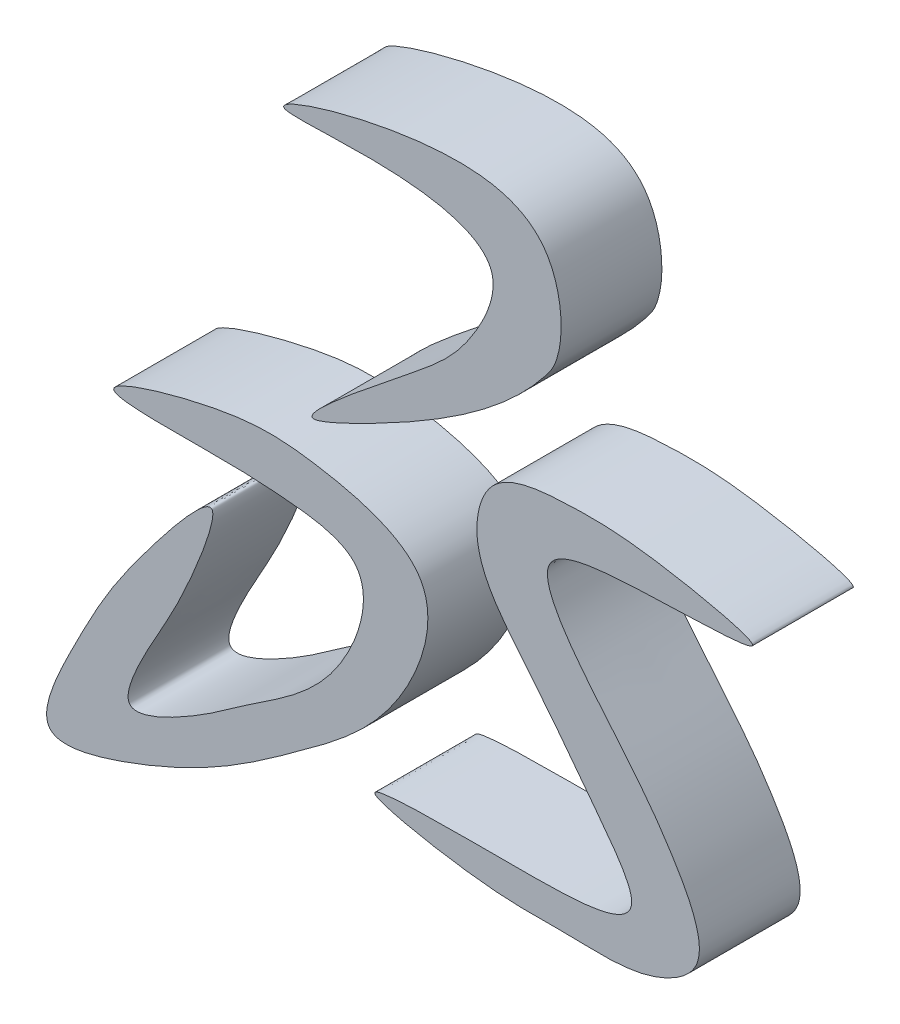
ISO-10303-21;
HEADER;
FILE_DESCRIPTION(('STEP AP214'),'2;1');
FILE_NAME('part.step','',(''),(''),'','','');
FILE_SCHEMA(('AUTOMOTIVE_DESIGN { 1 0 10303 214 1 1 1 1 }'));
ENDSEC;
DATA;
#1=APPLICATION_CONTEXT('core data for automotive mechanical design processes');
#2=APPLICATION_PROTOCOL_DEFINITION('international standard','automotive_design',2000,#1);
#3=PRODUCT_CONTEXT('',#1,'mechanical');
#4=PRODUCT('Part','Part','',(#3));
#5=PRODUCT_RELATED_PRODUCT_CATEGORY('part','',(#4));
#6=PRODUCT_DEFINITION_FORMATION('','',#4);
#7=PRODUCT_DEFINITION_CONTEXT('part definition',#1,'design');
#8=PRODUCT_DEFINITION('design','',#6,#7);
#9=PRODUCT_DEFINITION_SHAPE('','',#8);
#10=(LENGTH_UNIT() NAMED_UNIT(*) SI_UNIT(.MILLI.,.METRE.));
#11=(NAMED_UNIT(*) PLANE_ANGLE_UNIT() SI_UNIT($,.RADIAN.));
#12=(NAMED_UNIT(*) SI_UNIT($,.STERADIAN.) SOLID_ANGLE_UNIT());
#13=UNCERTAINTY_MEASURE_WITH_UNIT(LENGTH_MEASURE(1.E-05),#10,'distance_accuracy_value','');
#14=(GEOMETRIC_REPRESENTATION_CONTEXT(3) GLOBAL_UNCERTAINTY_ASSIGNED_CONTEXT((#13)) GLOBAL_UNIT_ASSIGNED_CONTEXT((#10,
#11,#12)) REPRESENTATION_CONTEXT('',''));
#15=CARTESIAN_POINT('',(0.,0.,0.));
#16=DIRECTION('',(0.,0.,1.));
#17=DIRECTION('',(1.,0.,0.));
#18=AXIS2_PLACEMENT_3D('',#15,#16,#17);
#19=CARTESIAN_POINT('',(-46.2111331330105,62.5617453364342,3.));
#20=CARTESIAN_POINT('',(-46.0700654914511,62.3706267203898,3.));
#21=CARTESIAN_POINT('',(-43.2617302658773,62.4180298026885,3.));
#22=CARTESIAN_POINT('',(-41.3856636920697,62.3727058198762,3.));
#23=CARTESIAN_POINT('',(-38.168710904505,62.0019418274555,3.));
#24=CARTESIAN_POINT('',(-39.4628284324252,58.088096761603,3.));
#25=CARTESIAN_POINT('',(-41.875880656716,56.7588453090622,3.));
#26=CARTESIAN_POINT('',(-43.5925380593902,55.439930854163,3.));
#27=CARTESIAN_POINT('',(-46.3846535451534,53.9492269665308,3.));
#28=CARTESIAN_POINT('',(-45.1347675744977,56.6142211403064,3.));
#29=CARTESIAN_POINT('',(-44.254641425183,57.9531861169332,3.));
#30=CARTESIAN_POINT('',(-42.4029236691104,62.5206770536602,3.));
#31=CARTESIAN_POINT('',(-46.0545791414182,57.9518081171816,3.));
#32=CARTESIAN_POINT('',(-46.9726148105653,56.2799210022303,3.));
#33=CARTESIAN_POINT('',(-49.0014656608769,52.1583720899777,3.));
#34=CARTESIAN_POINT('',(-43.955614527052,53.6691658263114,3.));
#35=CARTESIAN_POINT('',(-41.2268964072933,55.6348293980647,3.));
#36=CARTESIAN_POINT('',(-37.6594659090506,58.2344147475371,3.));
#37=CARTESIAN_POINT('',(-36.0458009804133,62.766264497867,3.));
#38=CARTESIAN_POINT('',(-40.2202416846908,63.7472162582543,3.));
#39=CARTESIAN_POINT('',(-42.7318745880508,63.8870764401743,3.));
#40=CARTESIAN_POINT('',(-46.3953175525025,62.8112786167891,3.));
#41=CARTESIAN_POINT('',(-46.2111331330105,62.5617453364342,3.));
#42=B_SPLINE_CURVE_WITH_KNOTS('',3,(#19,#20,#21,#22,#23,#24,#25,#26,#27,#28,#29,#30,#31,#32,#33,
#34,#35,#36,#37,#38,#39,#40,#41),.UNSPECIFIED.,.T.,.F.,(4,1,1,1,1,1,1,1,1,1,1,1,1,1,1,1,1,1,1,1,
4),(0.,0.0454444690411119,0.0860179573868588,0.122709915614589,0.172667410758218,
0.233439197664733,0.260911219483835,0.298832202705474,0.325903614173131,0.359106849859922,
0.412139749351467,0.4628705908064,0.530545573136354,0.573057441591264,0.614659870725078,
0.711680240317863,0.778007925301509,0.837923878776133,0.89671691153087,0.940665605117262,1.),.UNSPECIFIED.);
#43=DIRECTION('',(0.,0.,-1.));
#44=VECTOR('',#43,1.);
#45=SURFACE_OF_LINEAR_EXTRUSION('',#42,#44);
#46=CARTESIAN_POINT('',(-46.2111331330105,62.5617453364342,3.));
#47=VERTEX_POINT('',#46);
#48=EDGE_CURVE('E11',#47,#47,#42,.T.);
#49=ORIENTED_EDGE('',*,*,#48,.F.);
#50=EDGE_LOOP('',(#49));
#51=FACE_BOUND('',#50,.T.);
#52=CARTESIAN_POINT('',(-46.2111331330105,62.5617453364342,0.));
#53=CARTESIAN_POINT('',(-46.0700654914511,62.3706267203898,0.));
#54=CARTESIAN_POINT('',(-43.2617302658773,62.4180298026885,0.));
#55=CARTESIAN_POINT('',(-41.3856636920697,62.3727058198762,0.));
#56=CARTESIAN_POINT('',(-38.168710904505,62.0019418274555,0.));
#57=CARTESIAN_POINT('',(-39.4628284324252,58.088096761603,0.));
#58=CARTESIAN_POINT('',(-41.875880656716,56.7588453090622,0.));
#59=CARTESIAN_POINT('',(-43.5925380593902,55.439930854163,0.));
#60=CARTESIAN_POINT('',(-46.3846535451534,53.9492269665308,0.));
#61=CARTESIAN_POINT('',(-45.1347675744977,56.6142211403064,0.));
#62=CARTESIAN_POINT('',(-44.254641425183,57.9531861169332,0.));
#63=CARTESIAN_POINT('',(-42.4029236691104,62.5206770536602,0.));
#64=CARTESIAN_POINT('',(-46.0545791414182,57.9518081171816,0.));
#65=CARTESIAN_POINT('',(-46.9726148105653,56.2799210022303,0.));
#66=CARTESIAN_POINT('',(-49.0014656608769,52.1583720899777,0.));
#67=CARTESIAN_POINT('',(-43.955614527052,53.6691658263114,0.));
#68=CARTESIAN_POINT('',(-41.2268964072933,55.6348293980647,0.));
#69=CARTESIAN_POINT('',(-37.6594659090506,58.2344147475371,0.));
#70=CARTESIAN_POINT('',(-36.0458009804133,62.766264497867,0.));
#71=CARTESIAN_POINT('',(-40.2202416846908,63.7472162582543,0.));
#72=CARTESIAN_POINT('',(-42.7318745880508,63.8870764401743,0.));
#73=CARTESIAN_POINT('',(-46.3953175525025,62.8112786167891,0.));
#74=CARTESIAN_POINT('',(-46.2111331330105,62.5617453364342,0.));
#75=B_SPLINE_CURVE_WITH_KNOTS('',3,(#52,#53,#54,#55,#56,#57,#58,#59,#60,#61,#62,#63,#64,#65,#66,
#67,#68,#69,#70,#71,#72,#73,#74),.UNSPECIFIED.,.T.,.F.,(4,1,1,1,1,1,1,1,1,1,1,1,1,1,1,1,1,1,1,1,
4),(0.,0.0454444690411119,0.0860179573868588,0.122709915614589,0.172667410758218,
0.233439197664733,0.260911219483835,0.298832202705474,0.325903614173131,0.359106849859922,
0.412139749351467,0.4628705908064,0.530545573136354,0.573057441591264,0.614659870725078,
0.711680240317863,0.778007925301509,0.837923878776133,0.89671691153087,0.940665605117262,1.),.UNSPECIFIED.);
#76=CARTESIAN_POINT('',(-46.2111331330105,62.5617453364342,0.));
#77=VERTEX_POINT('',#76);
#78=EDGE_CURVE('E49',#77,#77,#75,.T.);
#79=ORIENTED_EDGE('',*,*,#78,.T.);
#80=EDGE_LOOP('',(#79));
#81=FACE_BOUND('',#80,.T.);
#82=ADVANCED_FACE('F40',(#51,#81),#45,.F.);
#83=CARTESIAN_POINT('',(-46.590505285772,56.913326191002,3.));
#84=DIRECTION('',(0.,0.,1.));
#85=DIRECTION('',(1.,0.,0.));
#86=AXIS2_PLACEMENT_3D('',#83,#84,#85);
#87=PLANE('',#86);
#88=ORIENTED_EDGE('',*,*,#48,.T.);
#89=EDGE_LOOP('',(#88));
#90=FACE_BOUND('',#89,.T.);
#91=ADVANCED_FACE('F63',(#90),#87,.T.);
#92=CARTESIAN_POINT('',(-46.590505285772,56.913326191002,0.));
#93=DIRECTION('',(0.,0.,1.));
#94=DIRECTION('',(1.,0.,0.));
#95=AXIS2_PLACEMENT_3D('',#92,#93,#94);
#96=PLANE('',#95);
#97=ORIENTED_EDGE('',*,*,#78,.F.);
#98=EDGE_LOOP('',(#97));
#99=FACE_BOUND('',#98,.T.);
#100=ADVANCED_FACE('F61',(#99),#96,.F.);
#101=CLOSED_SHELL('',(#82,#91,#100));
#102=MANIFOLD_SOLID_BREP('B2',#101);
#103=CARTESIAN_POINT('',(-27.2032125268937,65.5216252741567,3.));
#104=CARTESIAN_POINT('',(-27.2957513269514,65.7087479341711,3.));
#105=CARTESIAN_POINT('',(-30.401193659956,66.3779431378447,3.));
#106=CARTESIAN_POINT('',(-32.5028022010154,66.4305923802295,3.));
#107=CARTESIAN_POINT('',(-35.0869492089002,66.2004474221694,3.));
#108=CARTESIAN_POINT('',(-35.709623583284,63.6672111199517,3.));
#109=CARTESIAN_POINT('',(-33.7308738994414,61.3933329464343,3.));
#110=CARTESIAN_POINT('',(-32.255688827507,59.4394585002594,3.));
#111=CARTESIAN_POINT('',(-29.8577818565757,56.2642538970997,3.));
#112=CARTESIAN_POINT('',(-34.4820683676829,56.2565520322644,3.));
#113=CARTESIAN_POINT('',(-40.5638674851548,56.2776432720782,3.));
#114=CARTESIAN_POINT('',(-35.0414854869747,55.1977417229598,3.));
#115=CARTESIAN_POINT('',(-32.5750527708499,55.3413060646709,3.));
#116=CARTESIAN_POINT('',(-30.4744476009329,55.1576116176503,3.));
#117=CARTESIAN_POINT('',(-28.2469868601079,56.4648257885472,3.));
#118=CARTESIAN_POINT('',(-29.7911336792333,59.4102549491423,3.));
#119=CARTESIAN_POINT('',(-31.3912362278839,61.2189996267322,3.));
#120=CARTESIAN_POINT('',(-34.3822011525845,64.9286898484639,3.));
#121=CARTESIAN_POINT('',(-30.5138847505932,65.3200364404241,3.));
#122=CARTESIAN_POINT('',(-27.0981487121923,65.3091757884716,3.));
#123=CARTESIAN_POINT('',(-27.2032125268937,65.5216252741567,3.));
#124=B_SPLINE_CURVE_WITH_KNOTS('',3,(#103,#104,#105,#106,#107,#108,#109,#110,#111,#112,#113,
#114,#115,#116,#117,#118,#119,#120,#121,#122,#123),.UNSPECIFIED.,.T.,.F.,(4,1,1,1,1,1,1,1,1,1,1,
1,1,1,1,1,1,1,4),(0.,0.0593088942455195,0.111284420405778,0.1550555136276,0.185463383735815,
0.242406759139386,0.31459070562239,0.351733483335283,0.424525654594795,0.503042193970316,
0.576497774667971,0.617653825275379,0.666549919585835,0.69694507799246,0.745475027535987,
0.815497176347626,0.879518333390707,0.93266371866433,1.),.UNSPECIFIED.);
#125=DIRECTION('',(0.,0.,-1.));
#126=VECTOR('',#125,1.);
#127=SURFACE_OF_LINEAR_EXTRUSION('',#124,#126);
#128=CARTESIAN_POINT('',(-27.2032125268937,65.5216252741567,3.));
#129=VERTEX_POINT('',#128);
#130=EDGE_CURVE('E39',#129,#129,#124,.T.);
#131=ORIENTED_EDGE('',*,*,#130,.F.);
#132=EDGE_LOOP('',(#131));
#133=FACE_BOUND('',#132,.T.);
#134=CARTESIAN_POINT('',(-27.2032125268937,65.5216252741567,0.));
#135=CARTESIAN_POINT('',(-27.2957513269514,65.7087479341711,0.));
#136=CARTESIAN_POINT('',(-30.401193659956,66.3779431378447,0.));
#137=CARTESIAN_POINT('',(-32.5028022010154,66.4305923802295,0.));
#138=CARTESIAN_POINT('',(-35.0869492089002,66.2004474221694,0.));
#139=CARTESIAN_POINT('',(-35.709623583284,63.6672111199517,0.));
#140=CARTESIAN_POINT('',(-33.7308738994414,61.3933329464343,0.));
#141=CARTESIAN_POINT('',(-32.255688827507,59.4394585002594,0.));
#142=CARTESIAN_POINT('',(-29.8577818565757,56.2642538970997,0.));
#143=CARTESIAN_POINT('',(-34.4820683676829,56.2565520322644,0.));
#144=CARTESIAN_POINT('',(-40.5638674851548,56.2776432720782,0.));
#145=CARTESIAN_POINT('',(-35.0414854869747,55.1977417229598,0.));
#146=CARTESIAN_POINT('',(-32.5750527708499,55.3413060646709,0.));
#147=CARTESIAN_POINT('',(-30.4744476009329,55.1576116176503,0.));
#148=CARTESIAN_POINT('',(-28.2469868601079,56.4648257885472,0.));
#149=CARTESIAN_POINT('',(-29.7911336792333,59.4102549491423,0.));
#150=CARTESIAN_POINT('',(-31.3912362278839,61.2189996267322,0.));
#151=CARTESIAN_POINT('',(-34.3822011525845,64.9286898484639,0.));
#152=CARTESIAN_POINT('',(-30.5138847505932,65.3200364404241,0.));
#153=CARTESIAN_POINT('',(-27.0981487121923,65.3091757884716,0.));
#154=CARTESIAN_POINT('',(-27.2032125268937,65.5216252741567,0.));
#155=B_SPLINE_CURVE_WITH_KNOTS('',3,(#134,#135,#136,#137,#138,#139,#140,#141,#142,#143,#144,
#145,#146,#147,#148,#149,#150,#151,#152,#153,#154),.UNSPECIFIED.,.T.,.F.,(4,1,1,1,1,1,1,1,1,1,1,
1,1,1,1,1,1,1,4),(0.,0.0593088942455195,0.111284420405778,0.1550555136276,0.185463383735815,
0.242406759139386,0.31459070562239,0.351733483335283,0.424525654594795,0.503042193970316,
0.576497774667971,0.617653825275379,0.666549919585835,0.69694507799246,0.745475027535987,
0.815497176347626,0.879518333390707,0.93266371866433,1.),.UNSPECIFIED.);
#156=CARTESIAN_POINT('',(-27.2032125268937,65.5216252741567,0.));
#157=VERTEX_POINT('',#156);
#158=EDGE_CURVE('E108',#157,#157,#155,.T.);
#159=ORIENTED_EDGE('',*,*,#158,.T.);
#160=EDGE_LOOP('',(#159));
#161=FACE_BOUND('',#160,.T.);
#162=ADVANCED_FACE('F99',(#133,#161),#127,.F.);
#163=CARTESIAN_POINT('',(-38.4486473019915,56.0724105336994,3.));
#164=DIRECTION('',(0.,0.,-1.));
#165=DIRECTION('',(-1.,0.,0.));
#166=AXIS2_PLACEMENT_3D('',#163,#164,#165);
#167=PLANE('',#166);
#168=ORIENTED_EDGE('',*,*,#130,.T.);
#169=EDGE_LOOP('',(#168));
#170=FACE_BOUND('',#169,.T.);
#171=ADVANCED_FACE('F122',(#170),#167,.F.);
#172=CARTESIAN_POINT('',(-38.4486473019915,56.0724105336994,0.));
#173=DIRECTION('',(0.,0.,-1.));
#174=DIRECTION('',(-1.,0.,0.));
#175=AXIS2_PLACEMENT_3D('',#172,#173,#174);
#176=PLANE('',#175);
#177=ORIENTED_EDGE('',*,*,#158,.F.);
#178=EDGE_LOOP('',(#177));
#179=FACE_BOUND('',#178,.T.);
#180=ADVANCED_FACE('F120',(#179),#176,.T.);
#181=CLOSED_SHELL('',(#162,#171,#180));
#182=MANIFOLD_SOLID_BREP('B6',#181);
#183=CARTESIAN_POINT('',(-41.1482059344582,72.3818428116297,3.));
#184=CARTESIAN_POINT('',(-40.9608857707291,72.2255648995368,3.));
#185=CARTESIAN_POINT('',(-37.6782054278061,72.6328145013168,3.));
#186=CARTESIAN_POINT('',(-34.307268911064,71.6526848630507,3.));
#187=CARTESIAN_POINT('',(-35.7321651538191,68.7589652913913,3.));
#188=CARTESIAN_POINT('',(-37.3384928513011,67.4465093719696,3.));
#189=CARTESIAN_POINT('',(-41.621421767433,64.0599681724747,3.));
#190=CARTESIAN_POINT('',(-36.4940743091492,66.5009855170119,3.));
#191=CARTESIAN_POINT('',(-34.3782533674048,68.0278058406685,3.));
#192=CARTESIAN_POINT('',(-32.7669709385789,70.1533273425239,3.));
#193=CARTESIAN_POINT('',(-32.7992850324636,72.9719619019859,3.));
#194=CARTESIAN_POINT('',(-36.4458439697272,74.1527982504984,3.));
#195=CARTESIAN_POINT('',(-41.4134769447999,72.6031537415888,3.));
#196=CARTESIAN_POINT('',(-41.1482059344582,72.3818428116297,3.));
#197=B_SPLINE_CURVE_WITH_KNOTS('',3,(#183,#184,#185,#186,#187,#188,#189,#190,#191,#192,#193,
#194,#195,#196),.UNSPECIFIED.,.T.,.F.,(4,1,1,1,1,1,1,2,1,1,4),(0.,0.110632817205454,
0.186268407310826,0.24663199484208,0.324082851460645,0.431631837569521,0.483839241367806,
0.676218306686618,0.761929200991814,0.843328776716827,1.),.UNSPECIFIED.);
#198=DIRECTION('',(0.,0.,-1.));
#199=VECTOR('',#198,1.);
#200=SURFACE_OF_LINEAR_EXTRUSION('',#197,#199);
#201=CARTESIAN_POINT('',(-41.1482059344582,72.3818428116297,3.));
#202=VERTEX_POINT('',#201);
#203=EDGE_CURVE('E98',#202,#202,#197,.T.);
#204=ORIENTED_EDGE('',*,*,#203,.F.);
#205=EDGE_LOOP('',(#204));
#206=FACE_BOUND('',#205,.T.);
#207=CARTESIAN_POINT('',(-41.1482059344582,72.3818428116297,0.));
#208=CARTESIAN_POINT('',(-40.9608857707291,72.2255648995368,0.));
#209=CARTESIAN_POINT('',(-37.6782054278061,72.6328145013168,0.));
#210=CARTESIAN_POINT('',(-34.307268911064,71.6526848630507,0.));
#211=CARTESIAN_POINT('',(-35.7321651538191,68.7589652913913,0.));
#212=CARTESIAN_POINT('',(-37.3384928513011,67.4465093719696,0.));
#213=CARTESIAN_POINT('',(-41.621421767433,64.0599681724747,0.));
#214=CARTESIAN_POINT('',(-36.4940743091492,66.5009855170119,0.));
#215=CARTESIAN_POINT('',(-34.3782533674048,68.0278058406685,0.));
#216=CARTESIAN_POINT('',(-32.7669709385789,70.1533273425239,0.));
#217=CARTESIAN_POINT('',(-32.7992850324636,72.9719619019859,0.));
#218=CARTESIAN_POINT('',(-36.4458439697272,74.1527982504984,0.));
#219=CARTESIAN_POINT('',(-41.4134769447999,72.6031537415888,0.));
#220=CARTESIAN_POINT('',(-41.1482059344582,72.3818428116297,0.));
#221=B_SPLINE_CURVE_WITH_KNOTS('',3,(#207,#208,#209,#210,#211,#212,#213,#214,#215,#216,#217,
#218,#219,#220),.UNSPECIFIED.,.T.,.F.,(4,1,1,1,1,1,1,2,1,1,4),(0.,0.110632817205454,
0.186268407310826,0.24663199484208,0.324082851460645,0.431631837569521,0.483839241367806,
0.676218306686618,0.761929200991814,0.843328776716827,1.),.UNSPECIFIED.);
#222=CARTESIAN_POINT('',(-41.1482059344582,72.3818428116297,0.));
#223=VERTEX_POINT('',#222);
#224=EDGE_CURVE('E160',#223,#223,#221,.T.);
#225=ORIENTED_EDGE('',*,*,#224,.T.);
#226=EDGE_LOOP('',(#225));
#227=FACE_BOUND('',#226,.T.);
#228=ADVANCED_FACE('F151',(#206,#227),#200,.F.);
#229=CARTESIAN_POINT('',(-37.9748889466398,65.8485827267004,3.));
#230=DIRECTION('',(0.,0.,1.));
#231=DIRECTION('',(1.,0.,0.));
#232=AXIS2_PLACEMENT_3D('',#229,#230,#231);
#233=PLANE('',#232);
#234=ORIENTED_EDGE('',*,*,#203,.T.);
#235=EDGE_LOOP('',(#234));
#236=FACE_BOUND('',#235,.T.);
#237=ADVANCED_FACE('F174',(#236),#233,.T.);
#238=CARTESIAN_POINT('',(-37.9748889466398,65.8485827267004,0.));
#239=DIRECTION('',(0.,0.,1.));
#240=DIRECTION('',(1.,0.,0.));
#241=AXIS2_PLACEMENT_3D('',#238,#239,#240);
#242=PLANE('',#241);
#243=ORIENTED_EDGE('',*,*,#224,.F.);
#244=EDGE_LOOP('',(#243));
#245=FACE_BOUND('',#244,.T.);
#246=ADVANCED_FACE('F172',(#245),#242,.F.);
#247=CLOSED_SHELL('',(#228,#237,#246));
#248=MANIFOLD_SOLID_BREP('B34',#247);
#249=ADVANCED_BREP_SHAPE_REPRESENTATION('',(#18,#102,#182,#248),#14);
#250=SHAPE_DEFINITION_REPRESENTATION(#9,#249);
ENDSEC;
END-ISO-10303-21;
